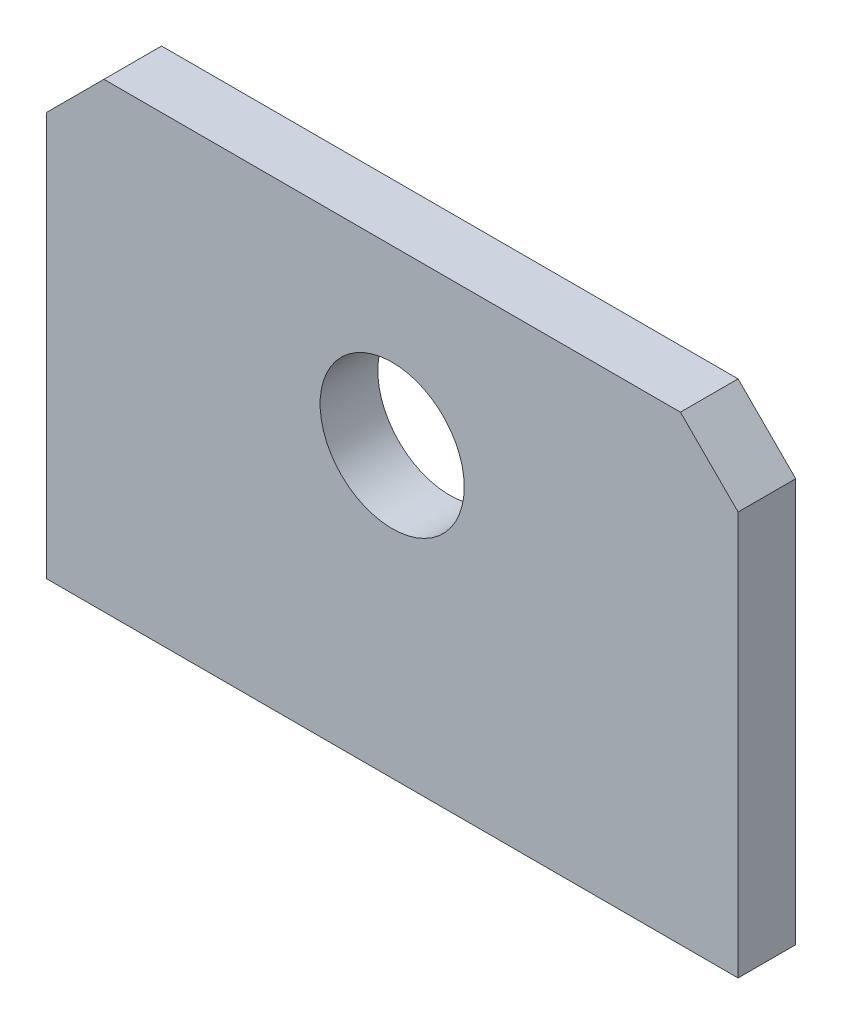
ISO-10303-21;
HEADER;
FILE_DESCRIPTION(('STEP AP214'),'2;1');
FILE_NAME('part.step','',(''),(''),'','','');
FILE_SCHEMA(('AUTOMOTIVE_DESIGN { 1 0 10303 214 1 1 1 1 }'));
ENDSEC;
DATA;
#1=APPLICATION_CONTEXT('core data for automotive mechanical design processes');
#2=APPLICATION_PROTOCOL_DEFINITION('international standard','automotive_design',2000,#1);
#3=PRODUCT_CONTEXT('',#1,'mechanical');
#4=PRODUCT('Part','Part','',(#3));
#5=PRODUCT_RELATED_PRODUCT_CATEGORY('part','',(#4));
#6=PRODUCT_DEFINITION_FORMATION('','',#4);
#7=PRODUCT_DEFINITION_CONTEXT('part definition',#1,'design');
#8=PRODUCT_DEFINITION('design','',#6,#7);
#9=PRODUCT_DEFINITION_SHAPE('','',#8);
#10=(LENGTH_UNIT() NAMED_UNIT(*) SI_UNIT(.MILLI.,.METRE.));
#11=(NAMED_UNIT(*) PLANE_ANGLE_UNIT() SI_UNIT($,.RADIAN.));
#12=(NAMED_UNIT(*) SI_UNIT($,.STERADIAN.) SOLID_ANGLE_UNIT());
#13=UNCERTAINTY_MEASURE_WITH_UNIT(LENGTH_MEASURE(1.E-05),#10,'distance_accuracy_value','');
#14=(GEOMETRIC_REPRESENTATION_CONTEXT(3) GLOBAL_UNCERTAINTY_ASSIGNED_CONTEXT((#13)) GLOBAL_UNIT_ASSIGNED_CONTEXT((#10,
#11,#12)) REPRESENTATION_CONTEXT('',''));
#15=CARTESIAN_POINT('',(0.,0.,0.));
#16=DIRECTION('',(0.,0.,1.));
#17=DIRECTION('',(1.,0.,0.));
#18=AXIS2_PLACEMENT_3D('',#15,#16,#17);
#19=CARTESIAN_POINT('',(0.,0.,6.35));
#20=DIRECTION('',(1.,0.,0.));
#21=DIRECTION('',(0.,1.,0.));
#22=AXIS2_PLACEMENT_3D('',#19,#20,#21);
#23=PLANE('',#22);
#24=DIRECTION('',(0.,-1.,0.));
#25=VECTOR('',#24,1.);
#26=CARTESIAN_POINT('',(0.,0.,6.35));
#27=LINE('',#26,#25);
#28=CARTESIAN_POINT('',(0.,-6.35,6.35));
#29=VERTEX_POINT('',#28);
#30=CARTESIAN_POINT('',(0.,-50.8,6.35));
#31=VERTEX_POINT('',#30);
#32=EDGE_CURVE('E124',#29,#31,#27,.T.);
#33=ORIENTED_EDGE('',*,*,#32,.F.);
#34=DIRECTION('',(0.,0.,-1.));
#35=VECTOR('',#34,1.);
#36=CARTESIAN_POINT('',(0.,-6.35000000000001,6.35));
#37=LINE('',#36,#35);
#38=CARTESIAN_POINT('',(0.,-6.35000000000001,0.));
#39=VERTEX_POINT('',#38);
#40=EDGE_CURVE('E85',#29,#39,#37,.T.);
#41=ORIENTED_EDGE('',*,*,#40,.T.);
#42=DIRECTION('',(0.,-1.,0.));
#43=VECTOR('',#42,1.);
#44=CARTESIAN_POINT('',(0.,0.,0.));
#45=LINE('',#44,#43);
#46=CARTESIAN_POINT('',(0.,-50.8,0.));
#47=VERTEX_POINT('',#46);
#48=EDGE_CURVE('E79',#39,#47,#45,.T.);
#49=ORIENTED_EDGE('',*,*,#48,.T.);
#50=DIRECTION('',(0.,0.,-1.));
#51=VECTOR('',#50,1.);
#52=CARTESIAN_POINT('',(0.,-50.8,6.35));
#53=LINE('',#52,#51);
#54=EDGE_CURVE('E83',#31,#47,#53,.T.);
#55=ORIENTED_EDGE('',*,*,#54,.F.);
#56=EDGE_LOOP('',(#33,#41,#49,#55));
#57=FACE_BOUND('',#56,.T.);
#58=ADVANCED_FACE('F26',(#57),#23,.F.);
#59=CARTESIAN_POINT('',(0.,-50.8,6.35));
#60=DIRECTION('',(0.,1.,0.));
#61=DIRECTION('',(0.,0.,1.));
#62=AXIS2_PLACEMENT_3D('',#59,#60,#61);
#63=PLANE('',#62);
#64=DIRECTION('',(1.,0.,0.));
#65=VECTOR('',#64,1.);
#66=CARTESIAN_POINT('',(0.,-50.8,0.));
#67=LINE('',#66,#65);
#68=CARTESIAN_POINT('',(76.2,-50.8,0.));
#69=VERTEX_POINT('',#68);
#70=EDGE_CURVE('E87',#47,#69,#67,.T.);
#71=ORIENTED_EDGE('',*,*,#70,.T.);
#72=DIRECTION('',(0.,0.,-1.));
#73=VECTOR('',#72,1.);
#74=CARTESIAN_POINT('',(76.2,-50.8,6.35));
#75=LINE('',#74,#73);
#76=CARTESIAN_POINT('',(76.2,-50.8,6.35));
#77=VERTEX_POINT('',#76);
#78=EDGE_CURVE('E99',#77,#69,#75,.T.);
#79=ORIENTED_EDGE('',*,*,#78,.F.);
#80=DIRECTION('',(1.,0.,0.));
#81=VECTOR('',#80,1.);
#82=CARTESIAN_POINT('',(0.,-50.8,6.35));
#83=LINE('',#82,#81);
#84=EDGE_CURVE('E98',#31,#77,#83,.T.);
#85=ORIENTED_EDGE('',*,*,#84,.F.);
#86=ORIENTED_EDGE('',*,*,#54,.T.);
#87=EDGE_LOOP('',(#71,#79,#85,#86));
#88=FACE_BOUND('',#87,.T.);
#89=ADVANCED_FACE('F97',(#88),#63,.F.);
#90=CARTESIAN_POINT('',(76.2,0.,6.35));
#91=DIRECTION('',(-1.,0.,0.));
#92=DIRECTION('',(0.,0.,1.));
#93=AXIS2_PLACEMENT_3D('',#90,#91,#92);
#94=PLANE('',#93);
#95=DIRECTION('',(0.,1.,0.));
#96=VECTOR('',#95,1.);
#97=CARTESIAN_POINT('',(76.2,0.,0.));
#98=LINE('',#97,#96);
#99=CARTESIAN_POINT('',(76.2,-6.35000000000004,0.));
#100=VERTEX_POINT('',#99);
#101=EDGE_CURVE('E91',#69,#100,#98,.T.);
#102=ORIENTED_EDGE('',*,*,#101,.T.);
#103=DIRECTION('',(0.,0.,1.));
#104=VECTOR('',#103,1.);
#105=CARTESIAN_POINT('',(76.2,-6.35000000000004,6.35));
#106=LINE('',#105,#104);
#107=CARTESIAN_POINT('',(76.2,-6.35000000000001,6.35));
#108=VERTEX_POINT('',#107);
#109=EDGE_CURVE('E33',#100,#108,#106,.T.);
#110=ORIENTED_EDGE('',*,*,#109,.T.);
#111=DIRECTION('',(0.,1.,0.));
#112=VECTOR('',#111,1.);
#113=CARTESIAN_POINT('',(76.2,0.,6.35));
#114=LINE('',#113,#112);
#115=EDGE_CURVE('E130',#77,#108,#114,.T.);
#116=ORIENTED_EDGE('',*,*,#115,.F.);
#117=ORIENTED_EDGE('',*,*,#78,.T.);
#118=EDGE_LOOP('',(#102,#110,#116,#117));
#119=FACE_BOUND('',#118,.T.);
#120=ADVANCED_FACE('F152',(#119),#94,.F.);
#121=CARTESIAN_POINT('',(0.,0.,6.35));
#122=DIRECTION('',(0.,-1.,0.));
#123=DIRECTION('',(0.,0.,-1.));
#124=AXIS2_PLACEMENT_3D('',#121,#122,#123);
#125=PLANE('',#124);
#126=DIRECTION('',(-1.,0.,0.));
#127=VECTOR('',#126,1.);
#128=CARTESIAN_POINT('',(0.,0.,6.35));
#129=LINE('',#128,#127);
#130=CARTESIAN_POINT('',(69.85,0.,6.35));
#131=VERTEX_POINT('',#130);
#132=CARTESIAN_POINT('',(6.35000000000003,0.,6.35));
#133=VERTEX_POINT('',#132);
#134=EDGE_CURVE('E103',#131,#133,#129,.T.);
#135=ORIENTED_EDGE('',*,*,#134,.F.);
#136=DIRECTION('',(0.,0.,-1.));
#137=VECTOR('',#136,1.);
#138=CARTESIAN_POINT('',(69.85,0.,6.35));
#139=LINE('',#138,#137);
#140=CARTESIAN_POINT('',(69.85,0.,0.));
#141=VERTEX_POINT('',#140);
#142=EDGE_CURVE('E113',#131,#141,#139,.T.);
#143=ORIENTED_EDGE('',*,*,#142,.T.);
#144=DIRECTION('',(-1.,0.,0.));
#145=VECTOR('',#144,1.);
#146=CARTESIAN_POINT('',(0.,0.,0.));
#147=LINE('',#146,#145);
#148=CARTESIAN_POINT('',(6.35000000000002,0.,0.));
#149=VERTEX_POINT('',#148);
#150=EDGE_CURVE('E120',#141,#149,#147,.T.);
#151=ORIENTED_EDGE('',*,*,#150,.T.);
#152=DIRECTION('',(0.,0.,1.));
#153=VECTOR('',#152,1.);
#154=CARTESIAN_POINT('',(6.35000000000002,0.,6.35));
#155=LINE('',#154,#153);
#156=EDGE_CURVE('E108',#149,#133,#155,.T.);
#157=ORIENTED_EDGE('',*,*,#156,.T.);
#158=EDGE_LOOP('',(#135,#143,#151,#157));
#159=FACE_BOUND('',#158,.T.);
#160=ADVANCED_FACE('F119',(#159),#125,.F.);
#161=CARTESIAN_POINT('',(0.,-50.8,6.35));
#162=DIRECTION('',(0.,0.,1.));
#163=DIRECTION('',(1.,0.,0.));
#164=AXIS2_PLACEMENT_3D('',#161,#162,#163);
#165=PLANE('',#164);
#166=CARTESIAN_POINT('',(38.1,-19.05,6.35));
#167=DIRECTION('',(0.,0.,1.));
#168=DIRECTION('',(1.,0.,0.));
#169=AXIS2_PLACEMENT_3D('',#166,#167,#168);
#170=CIRCLE('',#169,7.9375);
#171=CARTESIAN_POINT('',(46.0375,-19.05,6.35));
#172=VERTEX_POINT('',#171);
#173=EDGE_CURVE('E168',#172,#172,#170,.T.);
#174=ORIENTED_EDGE('',*,*,#173,.F.);
#175=EDGE_LOOP('',(#174));
#176=FACE_BOUND('',#175,.T.);
#177=ORIENTED_EDGE('',*,*,#115,.T.);
#178=DIRECTION('',(0.707106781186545,-0.70710678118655,0.));
#179=VECTOR('',#178,1.);
#180=CARTESIAN_POINT('',(60.3250000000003,9.52499999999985,6.35));
#181=LINE('',#180,#179);
#182=EDGE_CURVE('E11',#108,#131,#181,.F.);
#183=ORIENTED_EDGE('',*,*,#182,.T.);
#184=ORIENTED_EDGE('',*,*,#134,.T.);
#185=DIRECTION('',(0.707106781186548,0.707106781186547,0.));
#186=VECTOR('',#185,1.);
#187=CARTESIAN_POINT('',(-22.225,-28.5749999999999,6.35));
#188=LINE('',#187,#186);
#189=EDGE_CURVE('E111',#133,#29,#188,.F.);
#190=ORIENTED_EDGE('',*,*,#189,.T.);
#191=ORIENTED_EDGE('',*,*,#32,.T.);
#192=ORIENTED_EDGE('',*,*,#84,.T.);
#193=EDGE_LOOP('',(#177,#183,#184,#190,#191,#192));
#194=FACE_BOUND('',#193,.T.);
#195=ADVANCED_FACE('F132',(#176,#194),#165,.T.);
#196=CARTESIAN_POINT('',(0.,-50.8,0.));
#197=DIRECTION('',(0.,0.,1.));
#198=DIRECTION('',(1.,0.,0.));
#199=AXIS2_PLACEMENT_3D('',#196,#197,#198);
#200=PLANE('',#199);
#201=CARTESIAN_POINT('',(38.1,-19.05,0.));
#202=DIRECTION('',(0.,0.,1.));
#203=DIRECTION('',(1.,0.,0.));
#204=AXIS2_PLACEMENT_3D('',#201,#202,#203);
#205=CIRCLE('',#204,7.9375);
#206=CARTESIAN_POINT('',(46.0375,-19.05,0.));
#207=VERTEX_POINT('',#206);
#208=EDGE_CURVE('E88',#207,#207,#205,.T.);
#209=ORIENTED_EDGE('',*,*,#208,.T.);
#210=EDGE_LOOP('',(#209));
#211=FACE_BOUND('',#210,.T.);
#212=ORIENTED_EDGE('',*,*,#150,.F.);
#213=DIRECTION('',(-0.707106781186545,0.70710678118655,0.));
#214=VECTOR('',#213,1.);
#215=CARTESIAN_POINT('',(69.85,0.,0.));
#216=LINE('',#215,#214);
#217=EDGE_CURVE('E47',#141,#100,#216,.F.);
#218=ORIENTED_EDGE('',*,*,#217,.T.);
#219=ORIENTED_EDGE('',*,*,#101,.F.);
#220=ORIENTED_EDGE('',*,*,#70,.F.);
#221=ORIENTED_EDGE('',*,*,#48,.F.);
#222=DIRECTION('',(-0.707106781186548,-0.707106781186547,0.));
#223=VECTOR('',#222,1.);
#224=CARTESIAN_POINT('',(0.,-6.35000000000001,0.));
#225=LINE('',#224,#223);
#226=EDGE_CURVE('E101',#39,#149,#225,.F.);
#227=ORIENTED_EDGE('',*,*,#226,.T.);
#228=EDGE_LOOP('',(#212,#218,#219,#220,#221,#227));
#229=FACE_BOUND('',#228,.T.);
#230=ADVANCED_FACE('F90',(#211,#229),#200,.F.);
#231=CARTESIAN_POINT('',(38.1,-19.05,0.));
#232=DIRECTION('',(0.,0.,1.));
#233=DIRECTION('',(1.,0.,0.));
#234=AXIS2_PLACEMENT_3D('',#231,#232,#233);
#235=CYLINDRICAL_SURFACE('',#234,7.9375);
#236=ORIENTED_EDGE('',*,*,#208,.F.);
#237=EDGE_LOOP('',(#236));
#238=FACE_BOUND('',#237,.T.);
#239=ORIENTED_EDGE('',*,*,#173,.T.);
#240=EDGE_LOOP('',(#239));
#241=FACE_BOUND('',#240,.T.);
#242=ADVANCED_FACE('F138',(#238,#241),#235,.F.);
#243=CARTESIAN_POINT('',(0.,-6.35000000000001,6.35));
#244=DIRECTION('',(0.707106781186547,-0.707106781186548,0.));
#245=DIRECTION('',(0.707106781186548,0.707106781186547,0.));
#246=AXIS2_PLACEMENT_3D('',#243,#244,#245);
#247=PLANE('',#246);
#248=ORIENTED_EDGE('',*,*,#189,.F.);
#249=ORIENTED_EDGE('',*,*,#156,.F.);
#250=ORIENTED_EDGE('',*,*,#226,.F.);
#251=ORIENTED_EDGE('',*,*,#40,.F.);
#252=EDGE_LOOP('',(#248,#249,#250,#251));
#253=FACE_BOUND('',#252,.T.);
#254=ADVANCED_FACE('F135',(#253),#247,.F.);
#255=CARTESIAN_POINT('',(69.85,0.,6.35));
#256=DIRECTION('',(-0.70710678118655,-0.707106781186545,0.));
#257=DIRECTION('',(0.707106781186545,-0.70710678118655,0.));
#258=AXIS2_PLACEMENT_3D('',#255,#256,#257);
#259=PLANE('',#258);
#260=ORIENTED_EDGE('',*,*,#182,.F.);
#261=ORIENTED_EDGE('',*,*,#109,.F.);
#262=ORIENTED_EDGE('',*,*,#217,.F.);
#263=ORIENTED_EDGE('',*,*,#142,.F.);
#264=EDGE_LOOP('',(#260,#261,#262,#263));
#265=FACE_BOUND('',#264,.T.);
#266=ADVANCED_FACE('F137',(#265),#259,.F.);
#267=CLOSED_SHELL('',(#58,#89,#120,#160,#195,#230,#242,#254,#266));
#268=MANIFOLD_SOLID_BREP('B2',#267);
#269=ADVANCED_BREP_SHAPE_REPRESENTATION('',(#18,#268),#14);
#270=SHAPE_DEFINITION_REPRESENTATION(#9,#269);
ENDSEC;
END-ISO-10303-21;
